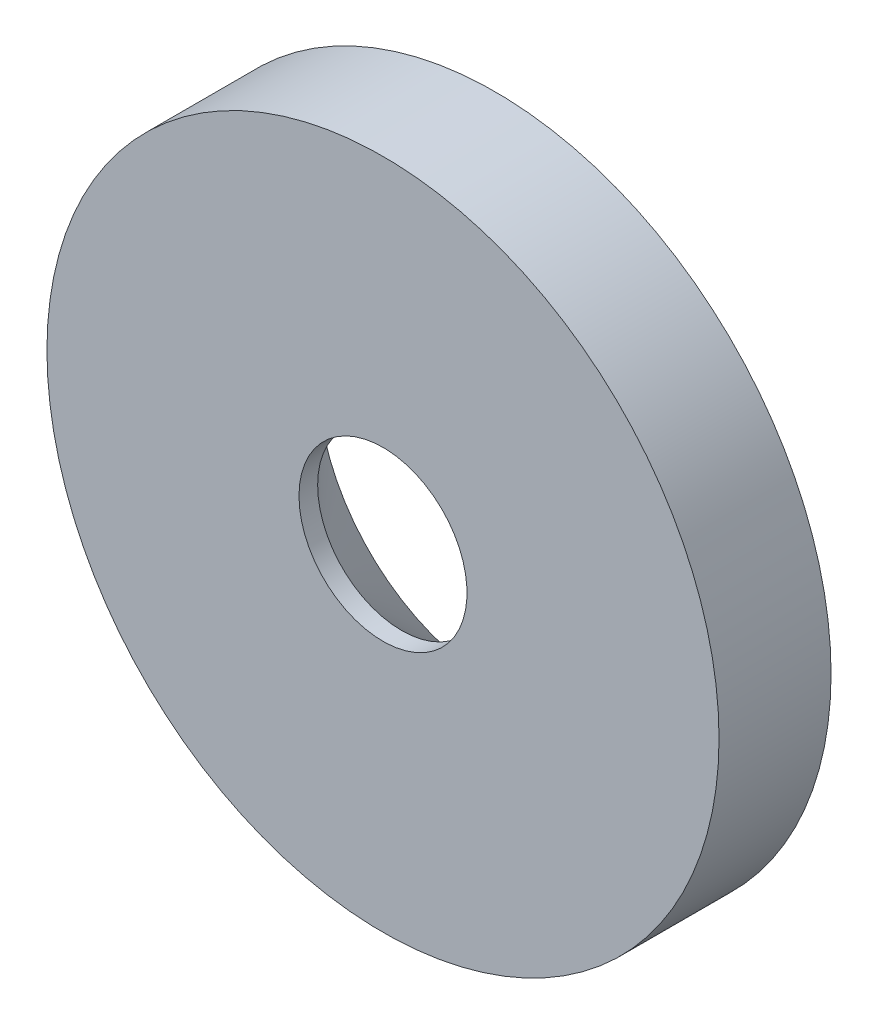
from build123d import *

# Parameters (mm, degrees)
ESQUISSE1_R             = 9
EXTRUSION1_DEPTH        = 3
ESQUISSE2_R             = 2.25
ENL_V_MAT_EXTRU_1_DEPTH = 14.076696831
CHANFREIN1_SIZE         = 2.5


with BuildPart() as part:
    # Esquisse1 → Extrusion1 (new body)
    with BuildSketch(Plane.XY):
        Circle(ESQUISSE1_R)
    extrude(amount=EXTRUSION1_DEPTH)

    # Esquisse2 → Enl_v. mat.-Extru.1 (cut, through all)
    with BuildSketch(Plane(origin=(0, 0, 0), x_dir=(-1, 0, 0), z_dir=(0, 0, -1))):
        Circle(ESQUISSE2_R)
    extrude(amount=-ENL_V_MAT_EXTRU_1_DEPTH, mode=Mode.SUBTRACT)

    # Chanfrein1
    chanfrein1_edges = [part.edges().sort_by_distance(p)[0] for p in [
        (2.25, 0, 0),
    ]]
    chamfer(chanfrein1_edges, length=CHANFREIN1_SIZE)


solid = part.part
